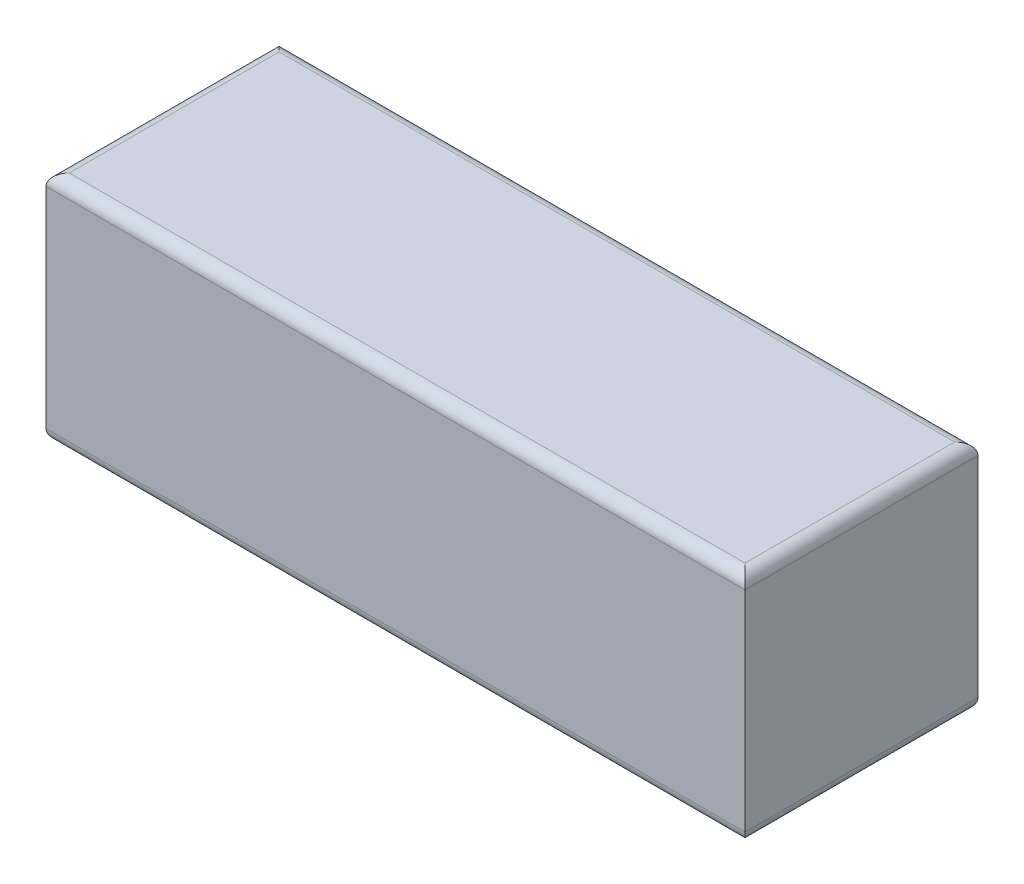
from build123d import *

# Parameters (mm, degrees)
SKETCH1_W           = 60
SKETCH1_H           = 20
BOSS_EXTRUDE1_DEPTH = 20
FILLET1_R           = 1


with BuildPart() as part:
    # Sketch1 → Boss-Extrude1 (new body)
    with BuildSketch(Plane(origin=(0, 0, 0), x_dir=(1, 0, 0), z_dir=(0, 1, 0))):
        with Locations((30, 10)):
            Rectangle(SKETCH1_W, SKETCH1_H)
    extrude(amount=BOSS_EXTRUDE1_DEPTH)

    # Fillet1
    fillet1_edges = [part.edges().sort_by_distance(p)[0] for p in [
        (60, 20, -10),
        (30, 20, -20),
        (0, 20, -10),
        (30, 0, -20),
        (60, 0, -10),
        (30, 0, 0),
        (0, 0, -10),
        (30, 20, 0),
    ]]
    fillet(fillet1_edges, radius=FILLET1_R)


solid = part.part
